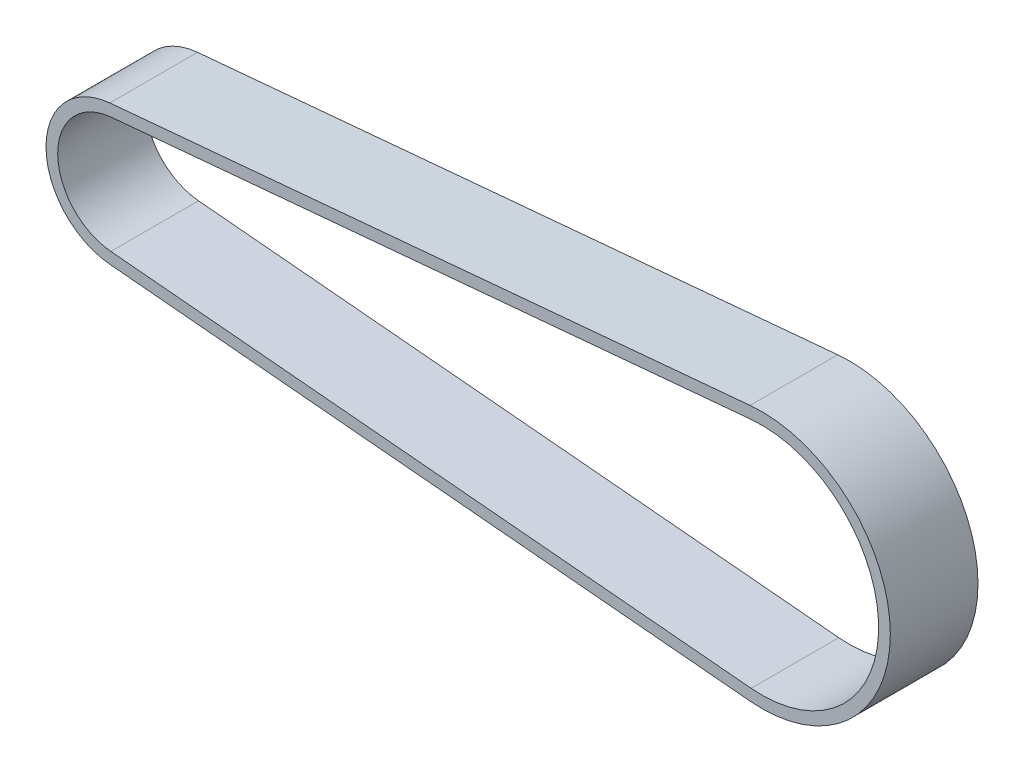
from build123d import *

# Parameters (mm, degrees)
EXTRU_MINCE1_DEPTH = 15


with BuildPart() as part:
    # Esquisse1 → Extru.-Mince1 (new body)
    with BuildSketch(Plane.XY):
        with BuildLine():
            Line((108.444766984, -21.909623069), (-1.086593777, -11.950703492))
            ThreePointArc((-1.086593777, -11.950703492), (-12, 0), (-1.086593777, 11.950703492))
            Line((-1.086593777, 11.950703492), (108.444766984, 21.909623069))
            ThreePointArc((108.444766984, 21.909623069), (132.436855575, 0), (108.444766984, -21.909623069))
        make_face()
        with BuildLine():
            Line((108.625865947, -19.917839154), (-0.905494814, -9.958919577))
            ThreePointArc((-0.905494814, -9.958919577), (-10, 0), (-0.905494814, 9.958919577))
            Line((-0.905494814, 9.958919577), (108.625865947, 19.917839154))
            ThreePointArc((108.625865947, 19.917839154), (130.436855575, 0), (108.625865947, -19.917839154))
        make_face(mode=Mode.SUBTRACT)
    extrude(amount=EXTRU_MINCE1_DEPTH)


solid = part.part
